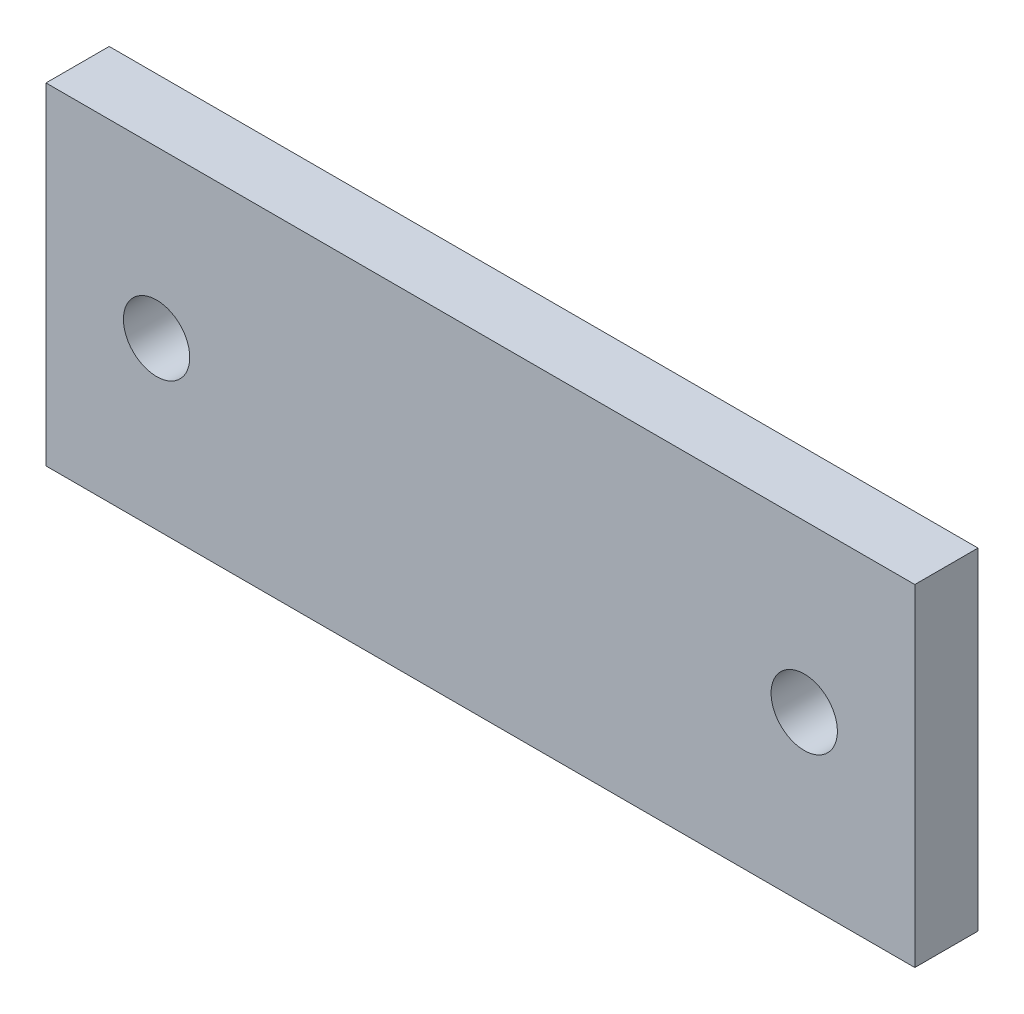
from build123d import *

# Parameters (mm, degrees)
ESQUISSE1_W           = 55
ESQUISSE1_H           = 21
EXTRUSION1_DEPTH      = 4
TROU_TARAUD_M5X0_81_D = 4.2


with BuildPart() as part:
    # Esquisse1 → Extrusion1 (new body)
    with BuildSketch(Plane.XY):
        Rectangle(ESQUISSE1_W, ESQUISSE1_H)
    extrude(amount=EXTRUSION1_DEPTH)

    # Trou taraud_ M5x0.81 (through all)
    with Locations(Plane.XY.offset(4)):
        with Locations((-20.5, 0), (20.5, 0)):
            Hole(TROU_TARAUD_M5X0_81_D / 2)


solid = part.part
